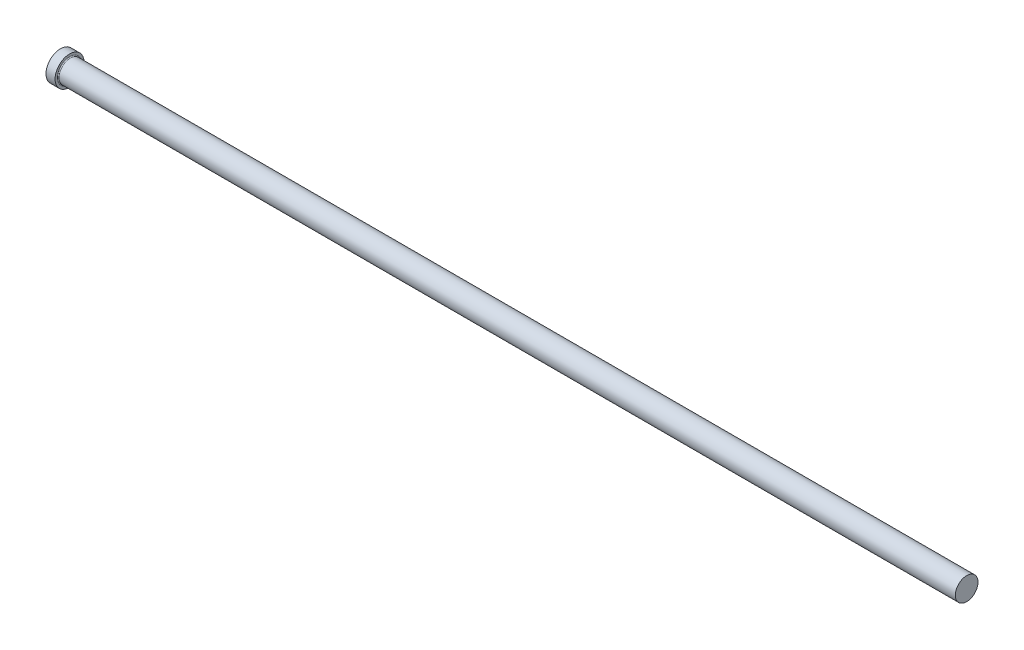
ISO-10303-21;
HEADER;
FILE_DESCRIPTION(('STEP AP214'),'2;1');
FILE_NAME('part.step','',(''),(''),'','','');
FILE_SCHEMA(('AUTOMOTIVE_DESIGN { 1 0 10303 214 1 1 1 1 }'));
ENDSEC;
DATA;
#1=APPLICATION_CONTEXT('core data for automotive mechanical design processes');
#2=APPLICATION_PROTOCOL_DEFINITION('international standard','automotive_design',2000,#1);
#3=PRODUCT_CONTEXT('',#1,'mechanical');
#4=PRODUCT('Part','Part','',(#3));
#5=PRODUCT_RELATED_PRODUCT_CATEGORY('part','',(#4));
#6=PRODUCT_DEFINITION_FORMATION('','',#4);
#7=PRODUCT_DEFINITION_CONTEXT('part definition',#1,'design');
#8=PRODUCT_DEFINITION('design','',#6,#7);
#9=PRODUCT_DEFINITION_SHAPE('','',#8);
#10=(LENGTH_UNIT() NAMED_UNIT(*) SI_UNIT(.MILLI.,.METRE.));
#11=(NAMED_UNIT(*) PLANE_ANGLE_UNIT() SI_UNIT($,.RADIAN.));
#12=(NAMED_UNIT(*) SI_UNIT($,.STERADIAN.) SOLID_ANGLE_UNIT());
#13=UNCERTAINTY_MEASURE_WITH_UNIT(LENGTH_MEASURE(1.E-05),#10,'distance_accuracy_value','');
#14=(GEOMETRIC_REPRESENTATION_CONTEXT(3) GLOBAL_UNCERTAINTY_ASSIGNED_CONTEXT((#13)) GLOBAL_UNIT_ASSIGNED_CONTEXT((#10,
#11,#12)) REPRESENTATION_CONTEXT('',''));
#15=CARTESIAN_POINT('',(0.,0.,0.));
#16=DIRECTION('',(0.,0.,1.));
#17=DIRECTION('',(1.,0.,0.));
#18=AXIS2_PLACEMENT_3D('',#15,#16,#17);
#19=CARTESIAN_POINT('',(0.,0.,0.));
#20=DIRECTION('',(-1.,0.,0.));
#21=DIRECTION('',(0.,-1.,0.));
#22=AXIS2_PLACEMENT_3D('',#19,#20,#21);
#23=PLANE('',#22);
#24=CARTESIAN_POINT('',(0.,0.,0.));
#25=DIRECTION('',(1.,0.,0.));
#26=DIRECTION('',(0.,1.,0.));
#27=AXIS2_PLACEMENT_3D('',#24,#25,#26);
#28=CIRCLE('',#27,16.);
#29=CARTESIAN_POINT('',(0.,16.,0.));
#30=VERTEX_POINT('',#29);
#31=EDGE_CURVE('E25',#30,#30,#28,.T.);
#32=ORIENTED_EDGE('',*,*,#31,.F.);
#33=EDGE_LOOP('',(#32));
#34=FACE_BOUND('',#33,.T.);
#35=ADVANCED_FACE('F14',(#34),#23,.T.);
#36=CARTESIAN_POINT('',(1000.,0.,0.));
#37=DIRECTION('',(1.,0.,0.));
#38=DIRECTION('',(0.,1.,0.));
#39=AXIS2_PLACEMENT_3D('',#36,#37,#38);
#40=CYLINDRICAL_SURFACE('',#39,16.);
#41=ORIENTED_EDGE('',*,*,#31,.T.);
#42=EDGE_LOOP('',(#41));
#43=FACE_BOUND('',#42,.T.);
#44=CARTESIAN_POINT('',(10.,0.,0.));
#45=DIRECTION('',(1.,0.,0.));
#46=DIRECTION('',(0.,1.,0.));
#47=AXIS2_PLACEMENT_3D('',#44,#45,#46);
#48=CIRCLE('',#47,16.);
#49=CARTESIAN_POINT('',(10.,16.,0.));
#50=VERTEX_POINT('',#49);
#51=EDGE_CURVE('E29',#50,#50,#48,.T.);
#52=ORIENTED_EDGE('',*,*,#51,.F.);
#53=EDGE_LOOP('',(#52));
#54=FACE_BOUND('',#53,.T.);
#55=ADVANCED_FACE('F51',(#43,#54),#40,.T.);
#56=CARTESIAN_POINT('',(10.,16.,0.));
#57=DIRECTION('',(1.,0.,0.));
#58=DIRECTION('',(0.,1.,0.));
#59=AXIS2_PLACEMENT_3D('',#56,#57,#58);
#60=PLANE('',#59);
#61=CARTESIAN_POINT('',(10.,0.,0.));
#62=DIRECTION('',(1.,0.,0.));
#63=DIRECTION('',(0.,1.,0.));
#64=AXIS2_PLACEMENT_3D('',#61,#62,#63);
#65=CIRCLE('',#64,13.5);
#66=CARTESIAN_POINT('',(10.,13.5,0.));
#67=VERTEX_POINT('',#66);
#68=EDGE_CURVE('E9',#67,#67,#65,.F.);
#69=ORIENTED_EDGE('',*,*,#68,.T.);
#70=EDGE_LOOP('',(#69));
#71=FACE_BOUND('',#70,.T.);
#72=ORIENTED_EDGE('',*,*,#51,.T.);
#73=EDGE_LOOP('',(#72));
#74=FACE_BOUND('',#73,.T.);
#75=ADVANCED_FACE('F42',(#71,#74),#60,.T.);
#76=CARTESIAN_POINT('',(1000.,0.,0.));
#77=DIRECTION('',(1.,0.,0.));
#78=DIRECTION('',(0.,1.,0.));
#79=AXIS2_PLACEMENT_3D('',#76,#77,#78);
#80=CYLINDRICAL_SURFACE('',#79,12.5);
#81=CARTESIAN_POINT('',(11.,0.,0.));
#82=DIRECTION('',(1.,0.,0.));
#83=DIRECTION('',(0.,1.,0.));
#84=AXIS2_PLACEMENT_3D('',#81,#82,#83);
#85=CIRCLE('',#84,12.5);
#86=CARTESIAN_POINT('',(11.,12.5,0.));
#87=VERTEX_POINT('',#86);
#88=EDGE_CURVE('E21',#87,#87,#85,.T.);
#89=ORIENTED_EDGE('',*,*,#88,.T.);
#90=EDGE_LOOP('',(#89));
#91=FACE_BOUND('',#90,.T.);
#92=CARTESIAN_POINT('',(1000.,0.,0.));
#93=DIRECTION('',(1.,0.,0.));
#94=DIRECTION('',(0.,1.,0.));
#95=AXIS2_PLACEMENT_3D('',#92,#93,#94);
#96=CIRCLE('',#95,12.4999999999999);
#97=CARTESIAN_POINT('',(1000.,12.4999999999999,0.));
#98=VERTEX_POINT('',#97);
#99=EDGE_CURVE('E34',#98,#98,#96,.T.);
#100=ORIENTED_EDGE('',*,*,#99,.F.);
#101=EDGE_LOOP('',(#100));
#102=FACE_BOUND('',#101,.T.);
#103=ADVANCED_FACE('F40',(#91,#102),#80,.T.);
#104=CARTESIAN_POINT('',(1000.,12.5,0.));
#105=DIRECTION('',(1.,0.,0.));
#106=DIRECTION('',(0.,1.,0.));
#107=AXIS2_PLACEMENT_3D('',#104,#105,#106);
#108=PLANE('',#107);
#109=ORIENTED_EDGE('',*,*,#99,.T.);
#110=EDGE_LOOP('',(#109));
#111=FACE_BOUND('',#110,.T.);
#112=ADVANCED_FACE('F38',(#111),#108,.T.);
#113=CARTESIAN_POINT('',(11.,0.,0.));
#114=DIRECTION('',(1.,0.,0.));
#115=DIRECTION('',(0.,1.,0.));
#116=AXIS2_PLACEMENT_3D('',#113,#114,#115);
#117=TOROIDAL_SURFACE('',#116,13.5,1.);
#118=ORIENTED_EDGE('',*,*,#68,.F.);
#119=EDGE_LOOP('',(#118));
#120=FACE_BOUND('',#119,.T.);
#121=ORIENTED_EDGE('',*,*,#88,.F.);
#122=EDGE_LOOP('',(#121));
#123=FACE_BOUND('',#122,.T.);
#124=ADVANCED_FACE('F16',(#120,#123),#117,.F.);
#125=CLOSED_SHELL('',(#35,#55,#75,#103,#112,#124));
#126=MANIFOLD_SOLID_BREP('B1',#125);
#127=ADVANCED_BREP_SHAPE_REPRESENTATION('',(#18,#126),#14);
#128=SHAPE_DEFINITION_REPRESENTATION(#9,#127);
ENDSEC;
END-ISO-10303-21;
